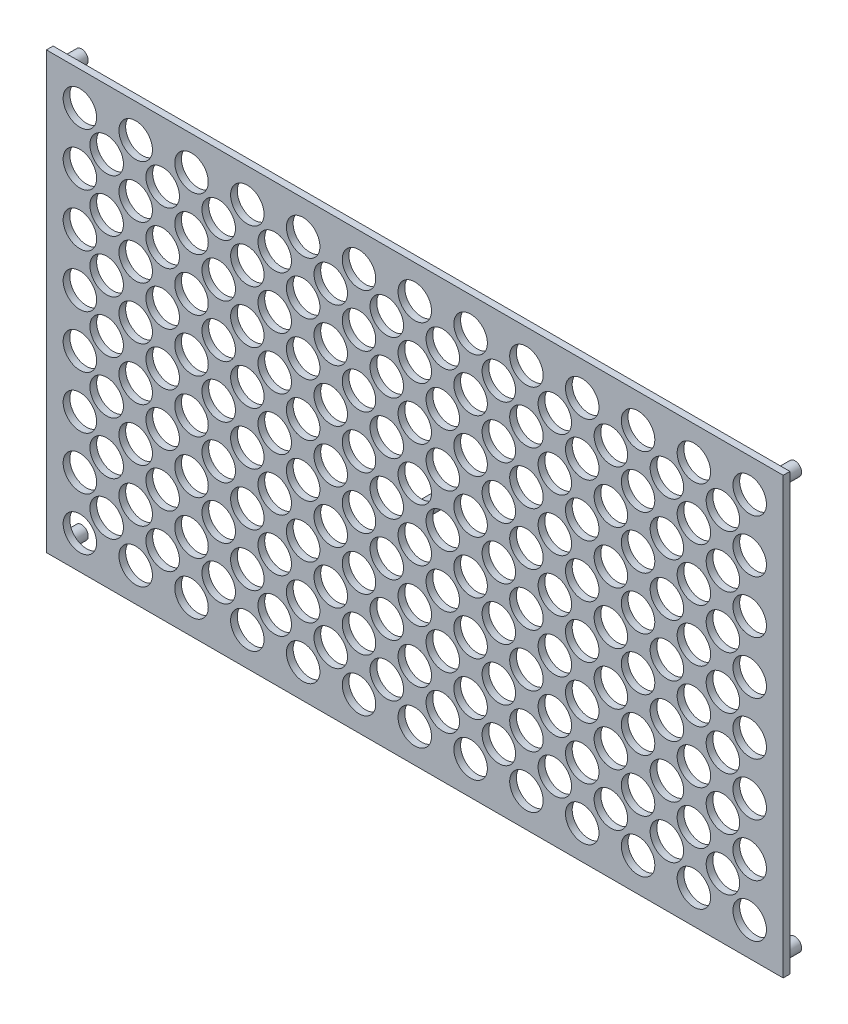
from build123d import *

# Parameters (mm, degrees)
GRUNDSKISS_W             = 220
GRUNDSKISS_H             = 130
BOTTENPLATTA_DEPTH       = 2
SKETCH2_R                = 5
YTTRE_H_L_DEPTH          = 128.784975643
SKETCH2_3_R              = 5
INRE_H_L_DEPTH           = 128.784975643
YTTRE_H_LBILD_COUNT      = 13
YTTRE_H_LBILD_PITCH      = 16.666666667
YTTRE_H_LBILD_COUNT_DIR2 = 8
YTTRE_H_LBILD_PITCH_DIR2 = 15.714285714
INRE_H_LBILD_COUNT       = 12
INRE_H_LBILD_PITCH       = 16.727272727
INRE_H_LBILD_COUNT_DIR2  = 7
INRE_H_LBILD_PITCH_DIR2  = 15.666666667
SKETCH3_R                = 2
FOT_DEPTH                = 5
FOR_PATTERN_COUNT        = 2
FOR_PATTERN_PITCH        = 123
FOR_PATTERN_COUNT_DIR2   = 2
FOR_PATTERN_PITCH_DIR2   = 213
SKETCH4_R                = 2
MITTENFOT_DEPTH          = 5
FILLET1_R                = 1


with BuildPart() as part:
    # Grundskiss → Bottenplatta (new body)
    with BuildSketch(Plane.XY):
        Rectangle(GRUNDSKISS_W, GRUNDSKISS_H)
    extrude(amount=BOTTENPLATTA_DEPTH)

    # Sketch2 → Yttre h_l (cut, through all)
    with BuildSketch(Plane.XY.offset(2)):
        with Locations((-100, 55)):
            Circle(SKETCH2_R)
    yttre_h_l = extrude(amount=-YTTRE_H_L_DEPTH, mode=Mode.SUBTRACT)

    # Sketch2_3 → Inre h_l (cut, through all)
    with BuildSketch(Plane.XY.offset(2)):
        with Locations((-92, 47)):
            Circle(SKETCH2_3_R)
    inre_h_l = extrude(amount=-INRE_H_L_DEPTH, mode=Mode.SUBTRACT)

    # Yttre h_lbild: Yttre h_l 13 × 8
    with Locations(*[(i * YTTRE_H_LBILD_PITCH, -j * YTTRE_H_LBILD_PITCH_DIR2, 0) for i in range(YTTRE_H_LBILD_COUNT) for j in range(YTTRE_H_LBILD_COUNT_DIR2) if (i, j) != (0, 0)]):
        add(yttre_h_l, mode=Mode.SUBTRACT)

    # Inre h_lbild: Inre h_l 12 × 7
    with Locations(*[(i * INRE_H_LBILD_PITCH, -j * INRE_H_LBILD_PITCH_DIR2, 0) for i in range(INRE_H_LBILD_COUNT) for j in range(INRE_H_LBILD_COUNT_DIR2) if (i, j) != (0, 0)]):
        add(inre_h_l, mode=Mode.SUBTRACT)

    # Sketch3 → Fot (add)
    with BuildSketch(Plane(origin=(0, 0, 0), x_dir=(-1, 0, 0), z_dir=(0, 0, -1))):
        with Locations(Location((106.5, -61.5, 0), (0, 0, 180))):
            Circle(SKETCH3_R)
    fot = extrude(amount=FOT_DEPTH)

    # For pattern: Fot 2 × 2
    with Locations(*[(j * FOR_PATTERN_PITCH_DIR2, i * FOR_PATTERN_PITCH, 0) for i in range(FOR_PATTERN_COUNT) for j in range(FOR_PATTERN_COUNT_DIR2) if (i, j) != (0, 0)]):
        add(fot)

    # Sketch4 → Mittenfot (add)
    with BuildSketch(Plane(origin=(0, 0, 0), x_dir=(-1, 0, 0), z_dir=(0, 0, -1))):
        with Locations(Location((0, 0, 0), (0, 0, 180))):
            Circle(SKETCH4_R)
    extrude(amount=MITTENFOT_DEPTH)

    # Fillet1
    fillet1_edges = [part.edges().sort_by_distance(p)[0] for p in [
        (-108.5, -61.5, 0),
        (104.5, -61.5, 0),
        (-108.5, 61.5, 0),
        (104.5, 61.5, 0),
        (-2, 0, 0),
    ]]
    fillet(fillet1_edges, radius=FILLET1_R)


solid = part.part
